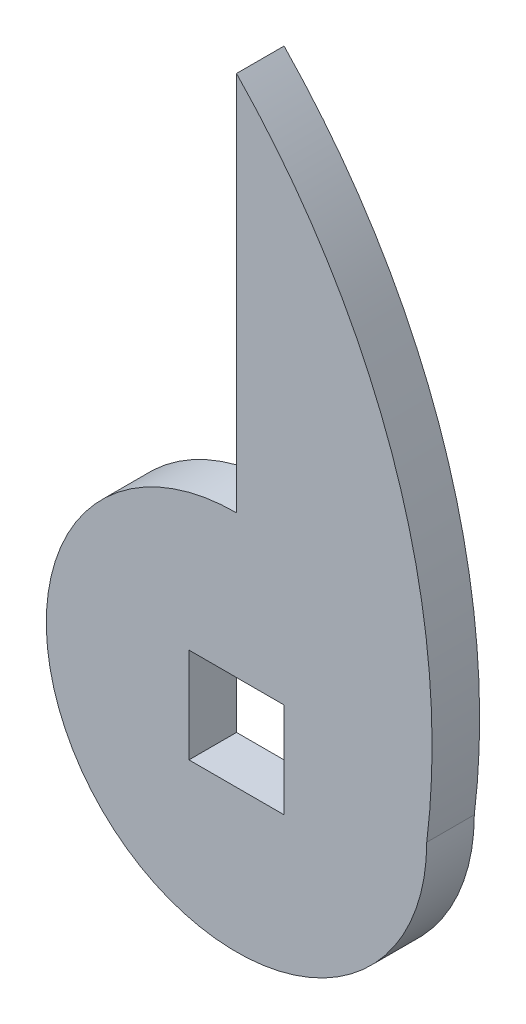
ISO-10303-21;
HEADER;
FILE_DESCRIPTION(('STEP AP214'),'2;1');
FILE_NAME('part.step','',(''),(''),'','','');
FILE_SCHEMA(('AUTOMOTIVE_DESIGN { 1 0 10303 214 1 1 1 1 }'));
ENDSEC;
DATA;
#1=APPLICATION_CONTEXT('core data for automotive mechanical design processes');
#2=APPLICATION_PROTOCOL_DEFINITION('international standard','automotive_design',2000,#1);
#3=PRODUCT_CONTEXT('',#1,'mechanical');
#4=PRODUCT('Part','Part','',(#3));
#5=PRODUCT_RELATED_PRODUCT_CATEGORY('part','',(#4));
#6=PRODUCT_DEFINITION_FORMATION('','',#4);
#7=PRODUCT_DEFINITION_CONTEXT('part definition',#1,'design');
#8=PRODUCT_DEFINITION('design','',#6,#7);
#9=PRODUCT_DEFINITION_SHAPE('','',#8);
#10=(LENGTH_UNIT() NAMED_UNIT(*) SI_UNIT(.MILLI.,.METRE.));
#11=(NAMED_UNIT(*) PLANE_ANGLE_UNIT() SI_UNIT($,.RADIAN.));
#12=(NAMED_UNIT(*) SI_UNIT($,.STERADIAN.) SOLID_ANGLE_UNIT());
#13=UNCERTAINTY_MEASURE_WITH_UNIT(LENGTH_MEASURE(1.E-05),#10,'distance_accuracy_value','');
#14=(GEOMETRIC_REPRESENTATION_CONTEXT(3) GLOBAL_UNCERTAINTY_ASSIGNED_CONTEXT((#13)) GLOBAL_UNIT_ASSIGNED_CONTEXT((#10,
#11,#12)) REPRESENTATION_CONTEXT('',''));
#15=CARTESIAN_POINT('',(0.,0.,0.));
#16=DIRECTION('',(0.,0.,1.));
#17=DIRECTION('',(1.,0.,0.));
#18=AXIS2_PLACEMENT_3D('',#15,#16,#17);
#19=CARTESIAN_POINT('',(-27.8410979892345,7.14841938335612,3.175));
#20=DIRECTION('',(0.,0.,1.));
#21=DIRECTION('',(1.,0.,0.));
#22=AXIS2_PLACEMENT_3D('',#19,#20,#21);
#23=PLANE('',#22);
#24=CARTESIAN_POINT('',(-27.8410979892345,7.14841938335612,3.175));
#25=DIRECTION('',(0.,0.,1.));
#26=DIRECTION('',(1.,0.,0.));
#27=AXIS2_PLACEMENT_3D('',#24,#25,#26);
#28=CIRCLE('',#27,12.7);
#29=CARTESIAN_POINT('',(-27.8410979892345,19.8484193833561,3.175));
#30=VERTEX_POINT('',#29);
#31=CARTESIAN_POINT('',(-15.1410979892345,7.14841938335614,3.175));
#32=VERTEX_POINT('',#31);
#33=EDGE_CURVE('E128',#30,#32,#28,.T.);
#34=ORIENTED_EDGE('',*,*,#33,.T.);
#35=CARTESIAN_POINT('',(-61.3877389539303,12.8995390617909,3.175));
#36=DIRECTION('',(0.,0.,1.));
#37=DIRECTION('',(-1.,0.,0.));
#38=AXIS2_PLACEMENT_3D('',#35,#36,#37);
#39=CIRCLE('',#38,46.6028666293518);
#40=CARTESIAN_POINT('',(-27.8410979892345,45.2484193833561,3.175));
#41=VERTEX_POINT('',#40);
#42=EDGE_CURVE('E131',#32,#41,#39,.T.);
#43=ORIENTED_EDGE('',*,*,#42,.T.);
#44=DIRECTION('',(0.,-1.,0.));
#45=VECTOR('',#44,1.);
#46=CARTESIAN_POINT('',(-27.8410979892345,19.8484193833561,3.175));
#47=LINE('',#46,#45);
#48=EDGE_CURVE('E134',#41,#30,#47,.T.);
#49=ORIENTED_EDGE('',*,*,#48,.T.);
#50=EDGE_LOOP('',(#34,#43,#49));
#51=FACE_BOUND('',#50,.T.);
#52=DIRECTION('',(-1.,0.,0.));
#53=VECTOR('',#52,1.);
#54=CARTESIAN_POINT('',(-31.0160979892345,10.3234193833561,3.175));
#55=LINE('',#54,#53);
#56=CARTESIAN_POINT('',(-24.6660979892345,10.3234193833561,3.175));
#57=VERTEX_POINT('',#56);
#58=CARTESIAN_POINT('',(-31.0160979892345,10.3234193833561,3.175));
#59=VERTEX_POINT('',#58);
#60=EDGE_CURVE('E100',#57,#59,#55,.T.);
#61=ORIENTED_EDGE('',*,*,#60,.F.);
#62=DIRECTION('',(0.,1.,0.));
#63=VECTOR('',#62,1.);
#64=CARTESIAN_POINT('',(-24.6660979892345,3.97341938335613,3.175));
#65=LINE('',#64,#63);
#66=CARTESIAN_POINT('',(-24.6660979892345,3.97341938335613,3.175));
#67=VERTEX_POINT('',#66);
#68=EDGE_CURVE('E92',#67,#57,#65,.T.);
#69=ORIENTED_EDGE('',*,*,#68,.F.);
#70=DIRECTION('',(1.,0.,0.));
#71=VECTOR('',#70,1.);
#72=CARTESIAN_POINT('',(-31.0160979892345,3.97341938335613,3.175));
#73=LINE('',#72,#71);
#74=CARTESIAN_POINT('',(-31.0160979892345,3.97341938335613,3.175));
#75=VERTEX_POINT('',#74);
#76=EDGE_CURVE('E114',#75,#67,#73,.T.);
#77=ORIENTED_EDGE('',*,*,#76,.F.);
#78=DIRECTION('',(0.,-1.,0.));
#79=VECTOR('',#78,1.);
#80=CARTESIAN_POINT('',(-31.0160979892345,3.97341938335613,3.175));
#81=LINE('',#80,#79);
#82=EDGE_CURVE('E112',#59,#75,#81,.T.);
#83=ORIENTED_EDGE('',*,*,#82,.F.);
#84=EDGE_LOOP('',(#61,#69,#77,#83));
#85=FACE_BOUND('',#84,.T.);
#86=ADVANCED_FACE('F33',(#51,#85),#23,.T.);
#87=CARTESIAN_POINT('',(-27.8410979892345,7.14841938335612,0.));
#88=DIRECTION('',(0.,0.,1.));
#89=DIRECTION('',(1.,0.,0.));
#90=AXIS2_PLACEMENT_3D('',#87,#88,#89);
#91=PLANE('',#90);
#92=CARTESIAN_POINT('',(-27.8410979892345,7.14841938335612,0.));
#93=DIRECTION('',(0.,0.,1.));
#94=DIRECTION('',(1.,0.,0.));
#95=AXIS2_PLACEMENT_3D('',#92,#93,#94);
#96=CIRCLE('',#95,12.7);
#97=CARTESIAN_POINT('',(-27.8410979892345,19.8484193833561,0.));
#98=VERTEX_POINT('',#97);
#99=CARTESIAN_POINT('',(-15.1410979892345,7.14841938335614,0.));
#100=VERTEX_POINT('',#99);
#101=EDGE_CURVE('E108',#98,#100,#96,.T.);
#102=ORIENTED_EDGE('',*,*,#101,.F.);
#103=DIRECTION('',(0.,-1.,0.));
#104=VECTOR('',#103,1.);
#105=CARTESIAN_POINT('',(-27.8410979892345,19.8484193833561,0.));
#106=LINE('',#105,#104);
#107=CARTESIAN_POINT('',(-27.8410979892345,45.2484193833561,0.));
#108=VERTEX_POINT('',#107);
#109=EDGE_CURVE('E132',#108,#98,#106,.T.);
#110=ORIENTED_EDGE('',*,*,#109,.F.);
#111=CARTESIAN_POINT('',(-61.3877389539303,12.8995390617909,0.));
#112=DIRECTION('',(0.,0.,1.));
#113=DIRECTION('',(-1.,0.,0.));
#114=AXIS2_PLACEMENT_3D('',#111,#112,#113);
#115=CIRCLE('',#114,46.6028666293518);
#116=EDGE_CURVE('E139',#100,#108,#115,.T.);
#117=ORIENTED_EDGE('',*,*,#116,.F.);
#118=EDGE_LOOP('',(#102,#110,#117));
#119=FACE_BOUND('',#118,.T.);
#120=DIRECTION('',(0.,1.,0.));
#121=VECTOR('',#120,1.);
#122=CARTESIAN_POINT('',(-24.6660979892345,3.97341938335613,0.));
#123=LINE('',#122,#121);
#124=CARTESIAN_POINT('',(-24.6660979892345,3.97341938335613,0.));
#125=VERTEX_POINT('',#124);
#126=CARTESIAN_POINT('',(-24.6660979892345,10.3234193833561,0.));
#127=VERTEX_POINT('',#126);
#128=EDGE_CURVE('E56',#125,#127,#123,.T.);
#129=ORIENTED_EDGE('',*,*,#128,.T.);
#130=DIRECTION('',(-1.,0.,0.));
#131=VECTOR('',#130,1.);
#132=CARTESIAN_POINT('',(-31.0160979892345,10.3234193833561,0.));
#133=LINE('',#132,#131);
#134=CARTESIAN_POINT('',(-31.0160979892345,10.3234193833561,0.));
#135=VERTEX_POINT('',#134);
#136=EDGE_CURVE('E107',#127,#135,#133,.T.);
#137=ORIENTED_EDGE('',*,*,#136,.T.);
#138=DIRECTION('',(0.,-1.,0.));
#139=VECTOR('',#138,1.);
#140=CARTESIAN_POINT('',(-31.0160979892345,3.97341938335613,0.));
#141=LINE('',#140,#139);
#142=CARTESIAN_POINT('',(-31.0160979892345,3.97341938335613,0.));
#143=VERTEX_POINT('',#142);
#144=EDGE_CURVE('E120',#135,#143,#141,.T.);
#145=ORIENTED_EDGE('',*,*,#144,.T.);
#146=DIRECTION('',(1.,0.,0.));
#147=VECTOR('',#146,1.);
#148=CARTESIAN_POINT('',(-31.0160979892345,3.97341938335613,0.));
#149=LINE('',#148,#147);
#150=EDGE_CURVE('E101',#143,#125,#149,.T.);
#151=ORIENTED_EDGE('',*,*,#150,.T.);
#152=EDGE_LOOP('',(#129,#137,#145,#151));
#153=FACE_BOUND('',#152,.T.);
#154=ADVANCED_FACE('F153',(#119,#153),#91,.F.);
#155=CARTESIAN_POINT('',(-27.8410979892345,7.14841938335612,3.175));
#156=DIRECTION('',(0.,0.,-1.));
#157=DIRECTION('',(-1.,0.,0.));
#158=AXIS2_PLACEMENT_3D('',#155,#156,#157);
#159=CYLINDRICAL_SURFACE('',#158,12.7);
#160=ORIENTED_EDGE('',*,*,#101,.T.);
#161=DIRECTION('',(0.,0.,-1.));
#162=VECTOR('',#161,1.);
#163=CARTESIAN_POINT('',(-15.1410979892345,7.14841938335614,3.175));
#164=LINE('',#163,#162);
#165=EDGE_CURVE('E11',#32,#100,#164,.T.);
#166=ORIENTED_EDGE('',*,*,#165,.F.);
#167=ORIENTED_EDGE('',*,*,#33,.F.);
#168=DIRECTION('',(0.,0.,-1.));
#169=VECTOR('',#168,1.);
#170=CARTESIAN_POINT('',(-27.8410979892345,19.8484193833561,3.175));
#171=LINE('',#170,#169);
#172=EDGE_CURVE('E136',#30,#98,#171,.T.);
#173=ORIENTED_EDGE('',*,*,#172,.T.);
#174=EDGE_LOOP('',(#160,#166,#167,#173));
#175=FACE_BOUND('',#174,.T.);
#176=ADVANCED_FACE('F35',(#175),#159,.T.);
#177=CARTESIAN_POINT('',(-61.3877389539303,12.8995390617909,3.175));
#178=DIRECTION('',(0.,0.,-1.));
#179=DIRECTION('',(-1.,0.,0.));
#180=AXIS2_PLACEMENT_3D('',#177,#178,#179);
#181=CYLINDRICAL_SURFACE('',#180,46.6028666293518);
#182=ORIENTED_EDGE('',*,*,#116,.T.);
#183=DIRECTION('',(0.,0.,-1.));
#184=VECTOR('',#183,1.);
#185=CARTESIAN_POINT('',(-27.8410979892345,45.2484193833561,3.175));
#186=LINE('',#185,#184);
#187=EDGE_CURVE('E41',#41,#108,#186,.T.);
#188=ORIENTED_EDGE('',*,*,#187,.F.);
#189=ORIENTED_EDGE('',*,*,#42,.F.);
#190=ORIENTED_EDGE('',*,*,#165,.T.);
#191=EDGE_LOOP('',(#182,#188,#189,#190));
#192=FACE_BOUND('',#191,.T.);
#193=ADVANCED_FACE('F159',(#192),#181,.T.);
#194=CARTESIAN_POINT('',(-27.8410979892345,19.8484193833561,3.175));
#195=DIRECTION('',(1.,0.,0.));
#196=DIRECTION('',(0.,0.,-1.));
#197=AXIS2_PLACEMENT_3D('',#194,#195,#196);
#198=PLANE('',#197);
#199=ORIENTED_EDGE('',*,*,#109,.T.);
#200=ORIENTED_EDGE('',*,*,#172,.F.);
#201=ORIENTED_EDGE('',*,*,#48,.F.);
#202=ORIENTED_EDGE('',*,*,#187,.T.);
#203=EDGE_LOOP('',(#199,#200,#201,#202));
#204=FACE_BOUND('',#203,.T.);
#205=ADVANCED_FACE('F148',(#204),#198,.F.);
#206=CARTESIAN_POINT('',(-24.6660979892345,3.97341938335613,3.175));
#207=DIRECTION('',(-1.,0.,0.));
#208=DIRECTION('',(0.,0.,1.));
#209=AXIS2_PLACEMENT_3D('',#206,#207,#208);
#210=PLANE('',#209);
#211=ORIENTED_EDGE('',*,*,#128,.F.);
#212=DIRECTION('',(0.,0.,-1.));
#213=VECTOR('',#212,1.);
#214=CARTESIAN_POINT('',(-24.6660979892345,3.97341938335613,3.175));
#215=LINE('',#214,#213);
#216=EDGE_CURVE('E96',#67,#125,#215,.T.);
#217=ORIENTED_EDGE('',*,*,#216,.F.);
#218=ORIENTED_EDGE('',*,*,#68,.T.);
#219=DIRECTION('',(0.,0.,-1.));
#220=VECTOR('',#219,1.);
#221=CARTESIAN_POINT('',(-24.6660979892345,10.3234193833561,3.175));
#222=LINE('',#221,#220);
#223=EDGE_CURVE('E95',#57,#127,#222,.T.);
#224=ORIENTED_EDGE('',*,*,#223,.T.);
#225=EDGE_LOOP('',(#211,#217,#218,#224));
#226=FACE_BOUND('',#225,.T.);
#227=ADVANCED_FACE('F94',(#226),#210,.T.);
#228=CARTESIAN_POINT('',(-31.0160979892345,10.3234193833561,3.175));
#229=DIRECTION('',(0.,-1.,0.));
#230=DIRECTION('',(0.,0.,-1.));
#231=AXIS2_PLACEMENT_3D('',#228,#229,#230);
#232=PLANE('',#231);
#233=ORIENTED_EDGE('',*,*,#136,.F.);
#234=ORIENTED_EDGE('',*,*,#223,.F.);
#235=ORIENTED_EDGE('',*,*,#60,.T.);
#236=DIRECTION('',(0.,0.,-1.));
#237=VECTOR('',#236,1.);
#238=CARTESIAN_POINT('',(-31.0160979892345,10.3234193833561,3.175));
#239=LINE('',#238,#237);
#240=EDGE_CURVE('E109',#59,#135,#239,.T.);
#241=ORIENTED_EDGE('',*,*,#240,.T.);
#242=EDGE_LOOP('',(#233,#234,#235,#241));
#243=FACE_BOUND('',#242,.T.);
#244=ADVANCED_FACE('F104',(#243),#232,.T.);
#245=CARTESIAN_POINT('',(-31.0160979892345,3.97341938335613,3.175));
#246=DIRECTION('',(1.,0.,0.));
#247=DIRECTION('',(0.,0.,-1.));
#248=AXIS2_PLACEMENT_3D('',#245,#246,#247);
#249=PLANE('',#248);
#250=ORIENTED_EDGE('',*,*,#144,.F.);
#251=ORIENTED_EDGE('',*,*,#240,.F.);
#252=ORIENTED_EDGE('',*,*,#82,.T.);
#253=DIRECTION('',(0.,0.,-1.));
#254=VECTOR('',#253,1.);
#255=CARTESIAN_POINT('',(-31.0160979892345,3.97341938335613,3.175));
#256=LINE('',#255,#254);
#257=EDGE_CURVE('E48',#75,#143,#256,.T.);
#258=ORIENTED_EDGE('',*,*,#257,.T.);
#259=EDGE_LOOP('',(#250,#251,#252,#258));
#260=FACE_BOUND('',#259,.T.);
#261=ADVANCED_FACE('F177',(#260),#249,.T.);
#262=CARTESIAN_POINT('',(-31.0160979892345,3.97341938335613,3.175));
#263=DIRECTION('',(0.,1.,0.));
#264=DIRECTION('',(0.,0.,1.));
#265=AXIS2_PLACEMENT_3D('',#262,#263,#264);
#266=PLANE('',#265);
#267=ORIENTED_EDGE('',*,*,#150,.F.);
#268=ORIENTED_EDGE('',*,*,#257,.F.);
#269=ORIENTED_EDGE('',*,*,#76,.T.);
#270=ORIENTED_EDGE('',*,*,#216,.T.);
#271=EDGE_LOOP('',(#267,#268,#269,#270));
#272=FACE_BOUND('',#271,.T.);
#273=ADVANCED_FACE('F180',(#272),#266,.T.);
#274=CLOSED_SHELL('',(#86,#154,#176,#193,#205,#227,#244,#261,#273));
#275=MANIFOLD_SOLID_BREP('B2',#274);
#276=ADVANCED_BREP_SHAPE_REPRESENTATION('',(#18,#275),#14);
#277=SHAPE_DEFINITION_REPRESENTATION(#9,#276);
ENDSEC;
END-ISO-10303-21;
